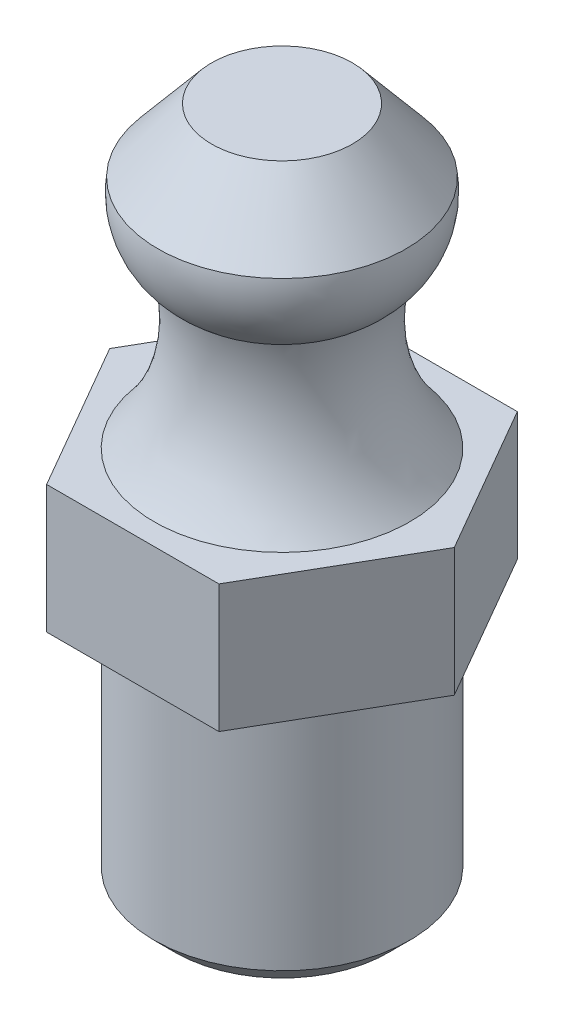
ISO-10303-21;
HEADER;
FILE_DESCRIPTION(('STEP AP214'),'2;1');
FILE_NAME('part.step','',(''),(''),'','','');
FILE_SCHEMA(('AUTOMOTIVE_DESIGN { 1 0 10303 214 1 1 1 1 }'));
ENDSEC;
DATA;
#1=APPLICATION_CONTEXT('core data for automotive mechanical design processes');
#2=APPLICATION_PROTOCOL_DEFINITION('international standard','automotive_design',2000,#1);
#3=PRODUCT_CONTEXT('',#1,'mechanical');
#4=PRODUCT('Part','Part','',(#3));
#5=PRODUCT_RELATED_PRODUCT_CATEGORY('part','',(#4));
#6=PRODUCT_DEFINITION_FORMATION('','',#4);
#7=PRODUCT_DEFINITION_CONTEXT('part definition',#1,'design');
#8=PRODUCT_DEFINITION('design','',#6,#7);
#9=PRODUCT_DEFINITION_SHAPE('','',#8);
#10=(LENGTH_UNIT() NAMED_UNIT(*) SI_UNIT(.MILLI.,.METRE.));
#11=(NAMED_UNIT(*) PLANE_ANGLE_UNIT() SI_UNIT($,.RADIAN.));
#12=(NAMED_UNIT(*) SI_UNIT($,.STERADIAN.) SOLID_ANGLE_UNIT());
#13=UNCERTAINTY_MEASURE_WITH_UNIT(LENGTH_MEASURE(1.E-05),#10,'distance_accuracy_value','');
#14=(GEOMETRIC_REPRESENTATION_CONTEXT(3) GLOBAL_UNCERTAINTY_ASSIGNED_CONTEXT((#13)) GLOBAL_UNIT_ASSIGNED_CONTEXT((#10,
#11,#12)) REPRESENTATION_CONTEXT('',''));
#15=CARTESIAN_POINT('',(0.,0.,0.));
#16=DIRECTION('',(0.,0.,1.));
#17=DIRECTION('',(1.,0.,0.));
#18=AXIS2_PLACEMENT_3D('',#15,#16,#17);
#19=CARTESIAN_POINT('',(6.06217782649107,3.,3.5));
#20=DIRECTION('',(0.,1.,0.));
#21=DIRECTION('',(0.,0.,1.));
#22=AXIS2_PLACEMENT_3D('',#19,#20,#21);
#23=PLANE('',#22);
#24=DIRECTION('',(1.,0.,0.));
#25=VECTOR('',#24,1.);
#26=CARTESIAN_POINT('',(-2.02072594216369,3.,3.5));
#27=LINE('',#26,#25);
#28=CARTESIAN_POINT('',(-2.02072594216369,3.,3.5));
#29=VERTEX_POINT('',#28);
#30=CARTESIAN_POINT('',(2.02072594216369,3.,3.5));
#31=VERTEX_POINT('',#30);
#32=EDGE_CURVE('E131',#29,#31,#27,.T.);
#33=ORIENTED_EDGE('',*,*,#32,.T.);
#34=DIRECTION('',(0.5,0.,-0.866025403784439));
#35=VECTOR('',#34,1.);
#36=CARTESIAN_POINT('',(2.02072594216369,3.,3.5));
#37=LINE('',#36,#35);
#38=CARTESIAN_POINT('',(4.04145188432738,3.,0.));
#39=VERTEX_POINT('',#38);
#40=EDGE_CURVE('E89',#31,#39,#37,.T.);
#41=ORIENTED_EDGE('',*,*,#40,.T.);
#42=DIRECTION('',(-0.5,0.,-0.866025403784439));
#43=VECTOR('',#42,1.);
#44=CARTESIAN_POINT('',(4.04145188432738,3.,0.));
#45=LINE('',#44,#43);
#46=CARTESIAN_POINT('',(2.02072594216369,3.,-3.5));
#47=VERTEX_POINT('',#46);
#48=EDGE_CURVE('E102',#39,#47,#45,.T.);
#49=ORIENTED_EDGE('',*,*,#48,.T.);
#50=DIRECTION('',(-1.,0.,0.));
#51=VECTOR('',#50,1.);
#52=CARTESIAN_POINT('',(2.02072594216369,3.,-3.5));
#53=LINE('',#52,#51);
#54=CARTESIAN_POINT('',(-2.02072594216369,3.,-3.5));
#55=VERTEX_POINT('',#54);
#56=EDGE_CURVE('E96',#47,#55,#53,.T.);
#57=ORIENTED_EDGE('',*,*,#56,.T.);
#58=DIRECTION('',(-0.5,0.,0.866025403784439));
#59=VECTOR('',#58,1.);
#60=CARTESIAN_POINT('',(-2.02072594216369,3.,-3.5));
#61=LINE('',#60,#59);
#62=CARTESIAN_POINT('',(-4.04145188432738,3.,0.));
#63=VERTEX_POINT('',#62);
#64=EDGE_CURVE('E100',#55,#63,#61,.T.);
#65=ORIENTED_EDGE('',*,*,#64,.T.);
#66=DIRECTION('',(0.5,0.,0.866025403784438));
#67=VECTOR('',#66,1.);
#68=CARTESIAN_POINT('',(-4.04145188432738,3.,0.));
#69=LINE('',#68,#67);
#70=EDGE_CURVE('E51',#63,#29,#69,.T.);
#71=ORIENTED_EDGE('',*,*,#70,.T.);
#72=EDGE_LOOP('',(#33,#41,#49,#57,#65,#71));
#73=FACE_BOUND('',#72,.T.);
#74=CARTESIAN_POINT('',(0.,3.,0.));
#75=DIRECTION('',(0.,-1.,0.));
#76=DIRECTION('',(0.,0.,-1.));
#77=AXIS2_PLACEMENT_3D('',#74,#75,#76);
#78=CIRCLE('',#77,3.);
#79=CARTESIAN_POINT('',(0.,3.,-3.));
#80=VERTEX_POINT('',#79);
#81=EDGE_CURVE('E296',#80,#80,#78,.T.);
#82=ORIENTED_EDGE('',*,*,#81,.T.);
#83=EDGE_LOOP('',(#82));
#84=FACE_BOUND('',#83,.T.);
#85=ADVANCED_FACE('F34',(#73,#84),#23,.T.);
#86=CARTESIAN_POINT('',(0.,-6.,0.));
#87=DIRECTION('',(0.,1.,0.));
#88=DIRECTION('',(0.,0.,1.));
#89=AXIS2_PLACEMENT_3D('',#86,#87,#88);
#90=CYLINDRICAL_SURFACE('',#89,3.);
#91=CARTESIAN_POINT('',(0.,-5.5,0.));
#92=DIRECTION('',(0.,1.,0.));
#93=DIRECTION('',(0.,0.,1.));
#94=AXIS2_PLACEMENT_3D('',#91,#92,#93);
#95=CIRCLE('',#94,3.);
#96=CARTESIAN_POINT('',(0.,-5.5,3.));
#97=VERTEX_POINT('',#96);
#98=EDGE_CURVE('E43',#97,#97,#95,.T.);
#99=ORIENTED_EDGE('',*,*,#98,.T.);
#100=EDGE_LOOP('',(#99));
#101=FACE_BOUND('',#100,.T.);
#102=CARTESIAN_POINT('',(0.,0.,0.));
#103=DIRECTION('',(0.,1.,0.));
#104=DIRECTION('',(0.,0.,1.));
#105=AXIS2_PLACEMENT_3D('',#102,#103,#104);
#106=CIRCLE('',#105,3.);
#107=CARTESIAN_POINT('',(0.,0.,3.));
#108=VERTEX_POINT('',#107);
#109=EDGE_CURVE('E140',#108,#108,#106,.T.);
#110=ORIENTED_EDGE('',*,*,#109,.F.);
#111=EDGE_LOOP('',(#110));
#112=FACE_BOUND('',#111,.T.);
#113=ADVANCED_FACE('F145',(#101,#112),#90,.T.);
#114=CARTESIAN_POINT('',(0.,-6.,0.));
#115=DIRECTION('',(0.,1.,0.));
#116=DIRECTION('',(0.,0.,1.));
#117=AXIS2_PLACEMENT_3D('',#114,#115,#116);
#118=PLANE('',#117);
#119=CARTESIAN_POINT('',(0.,-6.,0.));
#120=DIRECTION('',(0.,1.,0.));
#121=DIRECTION('',(0.,0.,1.));
#122=AXIS2_PLACEMENT_3D('',#119,#120,#121);
#123=CIRCLE('',#122,2.5);
#124=CARTESIAN_POINT('',(0.,-6.,2.5));
#125=VERTEX_POINT('',#124);
#126=EDGE_CURVE('E11',#125,#125,#123,.F.);
#127=ORIENTED_EDGE('',*,*,#126,.T.);
#128=EDGE_LOOP('',(#127));
#129=FACE_BOUND('',#128,.T.);
#130=ADVANCED_FACE('F163',(#129),#118,.F.);
#131=CARTESIAN_POINT('',(-2.02072594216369,3.,3.5));
#132=DIRECTION('',(0.,0.,-1.));
#133=DIRECTION('',(-1.,0.,0.));
#134=AXIS2_PLACEMENT_3D('',#131,#132,#133);
#135=PLANE('',#134);
#136=DIRECTION('',(1.,0.,0.));
#137=VECTOR('',#136,1.);
#138=CARTESIAN_POINT('',(-2.02072594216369,0.,3.5));
#139=LINE('',#138,#137);
#140=CARTESIAN_POINT('',(-2.02072594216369,0.,3.5));
#141=VERTEX_POINT('',#140);
#142=CARTESIAN_POINT('',(2.02072594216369,0.,3.5));
#143=VERTEX_POINT('',#142);
#144=EDGE_CURVE('E120',#141,#143,#139,.T.);
#145=ORIENTED_EDGE('',*,*,#144,.T.);
#146=DIRECTION('',(0.,-1.,0.));
#147=VECTOR('',#146,1.);
#148=CARTESIAN_POINT('',(2.02072594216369,3.,3.5));
#149=LINE('',#148,#147);
#150=EDGE_CURVE('E138',#31,#143,#149,.T.);
#151=ORIENTED_EDGE('',*,*,#150,.F.);
#152=ORIENTED_EDGE('',*,*,#32,.F.);
#153=DIRECTION('',(0.,-1.,0.));
#154=VECTOR('',#153,1.);
#155=CARTESIAN_POINT('',(-2.02072594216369,3.,3.5));
#156=LINE('',#155,#154);
#157=EDGE_CURVE('E116',#29,#141,#156,.T.);
#158=ORIENTED_EDGE('',*,*,#157,.T.);
#159=EDGE_LOOP('',(#145,#151,#152,#158));
#160=FACE_BOUND('',#159,.T.);
#161=ADVANCED_FACE('F186',(#160),#135,.F.);
#162=CARTESIAN_POINT('',(2.02072594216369,3.,3.5));
#163=DIRECTION('',(-0.866025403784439,0.,-0.5));
#164=DIRECTION('',(-0.5,0.,0.866025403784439));
#165=AXIS2_PLACEMENT_3D('',#162,#163,#164);
#166=PLANE('',#165);
#167=DIRECTION('',(0.5,0.,-0.866025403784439));
#168=VECTOR('',#167,1.);
#169=CARTESIAN_POINT('',(2.02072594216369,0.,3.5));
#170=LINE('',#169,#168);
#171=CARTESIAN_POINT('',(4.04145188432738,0.,0.));
#172=VERTEX_POINT('',#171);
#173=EDGE_CURVE('E123',#143,#172,#170,.T.);
#174=ORIENTED_EDGE('',*,*,#173,.T.);
#175=DIRECTION('',(0.,-1.,0.));
#176=VECTOR('',#175,1.);
#177=CARTESIAN_POINT('',(4.04145188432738,3.,0.));
#178=LINE('',#177,#176);
#179=EDGE_CURVE('E135',#39,#172,#178,.T.);
#180=ORIENTED_EDGE('',*,*,#179,.F.);
#181=ORIENTED_EDGE('',*,*,#40,.F.);
#182=ORIENTED_EDGE('',*,*,#150,.T.);
#183=EDGE_LOOP('',(#174,#180,#181,#182));
#184=FACE_BOUND('',#183,.T.);
#185=ADVANCED_FACE('F182',(#184),#166,.F.);
#186=CARTESIAN_POINT('',(4.04145188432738,3.,0.));
#187=DIRECTION('',(-0.866025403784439,0.,0.5));
#188=DIRECTION('',(0.5,0.,0.866025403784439));
#189=AXIS2_PLACEMENT_3D('',#186,#187,#188);
#190=PLANE('',#189);
#191=DIRECTION('',(-0.5,0.,-0.866025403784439));
#192=VECTOR('',#191,1.);
#193=CARTESIAN_POINT('',(4.04145188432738,0.,0.));
#194=LINE('',#193,#192);
#195=CARTESIAN_POINT('',(2.02072594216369,0.,-3.5));
#196=VERTEX_POINT('',#195);
#197=EDGE_CURVE('E126',#172,#196,#194,.T.);
#198=ORIENTED_EDGE('',*,*,#197,.T.);
#199=DIRECTION('',(0.,-1.,0.));
#200=VECTOR('',#199,1.);
#201=CARTESIAN_POINT('',(2.02072594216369,3.,-3.5));
#202=LINE('',#201,#200);
#203=EDGE_CURVE('E111',#47,#196,#202,.T.);
#204=ORIENTED_EDGE('',*,*,#203,.F.);
#205=ORIENTED_EDGE('',*,*,#48,.F.);
#206=ORIENTED_EDGE('',*,*,#179,.T.);
#207=EDGE_LOOP('',(#198,#204,#205,#206));
#208=FACE_BOUND('',#207,.T.);
#209=ADVANCED_FACE('F179',(#208),#190,.F.);
#210=CARTESIAN_POINT('',(2.02072594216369,3.,-3.5));
#211=DIRECTION('',(0.,0.,1.));
#212=DIRECTION('',(1.,0.,0.));
#213=AXIS2_PLACEMENT_3D('',#210,#211,#212);
#214=PLANE('',#213);
#215=DIRECTION('',(-1.,0.,0.));
#216=VECTOR('',#215,1.);
#217=CARTESIAN_POINT('',(2.02072594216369,0.,-3.5));
#218=LINE('',#217,#216);
#219=CARTESIAN_POINT('',(-2.02072594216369,0.,-3.5));
#220=VERTEX_POINT('',#219);
#221=EDGE_CURVE('E110',#196,#220,#218,.T.);
#222=ORIENTED_EDGE('',*,*,#221,.T.);
#223=DIRECTION('',(0.,-1.,0.));
#224=VECTOR('',#223,1.);
#225=CARTESIAN_POINT('',(-2.02072594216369,3.,-3.5));
#226=LINE('',#225,#224);
#227=EDGE_CURVE('E107',#55,#220,#226,.T.);
#228=ORIENTED_EDGE('',*,*,#227,.F.);
#229=ORIENTED_EDGE('',*,*,#56,.F.);
#230=ORIENTED_EDGE('',*,*,#203,.T.);
#231=EDGE_LOOP('',(#222,#228,#229,#230));
#232=FACE_BOUND('',#231,.T.);
#233=ADVANCED_FACE('F108',(#232),#214,.F.);
#234=CARTESIAN_POINT('',(-2.02072594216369,3.,-3.5));
#235=DIRECTION('',(0.866025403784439,0.,0.5));
#236=DIRECTION('',(0.5,0.,-0.866025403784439));
#237=AXIS2_PLACEMENT_3D('',#234,#235,#236);
#238=PLANE('',#237);
#239=DIRECTION('',(-0.5,0.,0.866025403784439));
#240=VECTOR('',#239,1.);
#241=CARTESIAN_POINT('',(-2.02072594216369,0.,-3.5));
#242=LINE('',#241,#240);
#243=CARTESIAN_POINT('',(-4.04145188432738,0.,0.));
#244=VERTEX_POINT('',#243);
#245=EDGE_CURVE('E74',#220,#244,#242,.T.);
#246=ORIENTED_EDGE('',*,*,#245,.T.);
#247=DIRECTION('',(0.,-1.,0.));
#248=VECTOR('',#247,1.);
#249=CARTESIAN_POINT('',(-4.04145188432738,3.,0.));
#250=LINE('',#249,#248);
#251=EDGE_CURVE('E112',#63,#244,#250,.T.);
#252=ORIENTED_EDGE('',*,*,#251,.F.);
#253=ORIENTED_EDGE('',*,*,#64,.F.);
#254=ORIENTED_EDGE('',*,*,#227,.T.);
#255=EDGE_LOOP('',(#246,#252,#253,#254));
#256=FACE_BOUND('',#255,.T.);
#257=ADVANCED_FACE('F114',(#256),#238,.F.);
#258=CARTESIAN_POINT('',(-4.04145188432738,3.,0.));
#259=DIRECTION('',(0.866025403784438,0.,-0.5));
#260=DIRECTION('',(-0.5,0.,-0.866025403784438));
#261=AXIS2_PLACEMENT_3D('',#258,#259,#260);
#262=PLANE('',#261);
#263=DIRECTION('',(0.5,0.,0.866025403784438));
#264=VECTOR('',#263,1.);
#265=CARTESIAN_POINT('',(-4.04145188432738,0.,0.));
#266=LINE('',#265,#264);
#267=EDGE_CURVE('E80',#244,#141,#266,.T.);
#268=ORIENTED_EDGE('',*,*,#267,.T.);
#269=ORIENTED_EDGE('',*,*,#157,.F.);
#270=ORIENTED_EDGE('',*,*,#70,.F.);
#271=ORIENTED_EDGE('',*,*,#251,.T.);
#272=EDGE_LOOP('',(#268,#269,#270,#271));
#273=FACE_BOUND('',#272,.T.);
#274=ADVANCED_FACE('F171',(#273),#262,.F.);
#275=CARTESIAN_POINT('',(6.06217782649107,0.,3.5));
#276=DIRECTION('',(0.,1.,0.));
#277=DIRECTION('',(0.,0.,1.));
#278=AXIS2_PLACEMENT_3D('',#275,#276,#277);
#279=PLANE('',#278);
#280=ORIENTED_EDGE('',*,*,#109,.T.);
#281=EDGE_LOOP('',(#280));
#282=FACE_BOUND('',#281,.T.);
#283=ORIENTED_EDGE('',*,*,#144,.F.);
#284=ORIENTED_EDGE('',*,*,#267,.F.);
#285=ORIENTED_EDGE('',*,*,#245,.F.);
#286=ORIENTED_EDGE('',*,*,#221,.F.);
#287=ORIENTED_EDGE('',*,*,#197,.F.);
#288=ORIENTED_EDGE('',*,*,#173,.F.);
#289=EDGE_LOOP('',(#283,#284,#285,#286,#287,#288));
#290=FACE_BOUND('',#289,.T.);
#291=ADVANCED_FACE('F168',(#282,#290),#279,.F.);
#292=CARTESIAN_POINT('',(0.,10.,0.));
#293=DIRECTION('',(0.,-1.,0.));
#294=DIRECTION('',(0.,0.,-1.));
#295=AXIS2_PLACEMENT_3D('',#292,#293,#294);
#296=PLANE('',#295);
#297=CARTESIAN_POINT('',(0.,10.,0.));
#298=DIRECTION('',(0.,-1.,0.));
#299=DIRECTION('',(0.,0.,-1.));
#300=AXIS2_PLACEMENT_3D('',#297,#298,#299);
#301=CIRCLE('',#300,1.65193034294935);
#302=CARTESIAN_POINT('',(0.,10.,-1.65193034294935));
#303=VERTEX_POINT('',#302);
#304=EDGE_CURVE('E124',#303,#303,#301,.T.);
#305=ORIENTED_EDGE('',*,*,#304,.F.);
#306=EDGE_LOOP('',(#305));
#307=FACE_BOUND('',#306,.T.);
#308=ADVANCED_FACE('F166',(#307),#296,.F.);
#309=CARTESIAN_POINT('',(0.,10.,0.));
#310=DIRECTION('',(0.,-1.,0.));
#311=DIRECTION('',(0.,0.,-1.));
#312=AXIS2_PLACEMENT_3D('',#309,#310,#311);
#313=CONICAL_SURFACE('',#312,1.65193034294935,0.698131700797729);
#314=CARTESIAN_POINT('',(0.,8.5,0.));
#315=DIRECTION('',(0.,-1.,0.));
#316=DIRECTION('',(0.,0.,-1.));
#317=AXIS2_PLACEMENT_3D('',#314,#315,#316);
#318=CIRCLE('',#317,2.91057978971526);
#319=CARTESIAN_POINT('',(0.,8.5,-2.91057978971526));
#320=VERTEX_POINT('',#319);
#321=EDGE_CURVE('E292',#320,#320,#318,.T.);
#322=ORIENTED_EDGE('',*,*,#321,.F.);
#323=EDGE_LOOP('',(#322));
#324=FACE_BOUND('',#323,.T.);
#325=ORIENTED_EDGE('',*,*,#304,.T.);
#326=EDGE_LOOP('',(#325));
#327=FACE_BOUND('',#326,.T.);
#328=ADVANCED_FACE('F230',(#324,#327),#313,.T.);
#329=CARTESIAN_POINT('',(0.,8.20703185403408,0.));
#330=DIRECTION('',(0.,-1.,0.));
#331=DIRECTION('',(0.,0.,-1.));
#332=AXIS2_PLACEMENT_3D('',#329,#330,#331);
#333=DEGENERATE_TOROIDAL_SURFACE('',#332,0.932153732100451,2.,.T.);
#334=CARTESIAN_POINT('',(0.,6.62716563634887,0.));
#335=DIRECTION('',(0.,-1.,0.));
#336=DIRECTION('',(0.,0.,-1.));
#337=AXIS2_PLACEMENT_3D('',#334,#335,#336);
#338=CIRCLE('',#337,2.15853977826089);
#339=CARTESIAN_POINT('',(0.,6.62716563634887,-2.15853977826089));
#340=VERTEX_POINT('',#339);
#341=EDGE_CURVE('E289',#340,#340,#338,.T.);
#342=ORIENTED_EDGE('',*,*,#341,.F.);
#343=EDGE_LOOP('',(#342));
#344=FACE_BOUND('',#343,.T.);
#345=ORIENTED_EDGE('',*,*,#321,.T.);
#346=EDGE_LOOP('',(#345));
#347=FACE_BOUND('',#346,.T.);
#348=ADVANCED_FACE('F154',(#344,#347),#333,.T.);
#349=CARTESIAN_POINT('',(0.,5.61364998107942,0.));
#350=DIRECTION('',(0.,-1.,0.));
#351=DIRECTION('',(0.,0.,-1.));
#352=AXIS2_PLACEMENT_3D('',#349,#350,#351);
#353=TOROIDAL_SURFACE('',#352,6.02800821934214,4.);
#354=ORIENTED_EDGE('',*,*,#81,.F.);
#355=EDGE_LOOP('',(#354));
#356=FACE_BOUND('',#355,.T.);
#357=ORIENTED_EDGE('',*,*,#341,.T.);
#358=EDGE_LOOP('',(#357));
#359=FACE_BOUND('',#358,.T.);
#360=ADVANCED_FACE('F149',(#356,#359),#353,.F.);
#361=CARTESIAN_POINT('',(0.,-5.5,0.));
#362=DIRECTION('',(0.,1.,0.));
#363=DIRECTION('',(0.,0.,1.));
#364=AXIS2_PLACEMENT_3D('',#361,#362,#363);
#365=CONICAL_SURFACE('',#364,3.,0.78539816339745);
#366=ORIENTED_EDGE('',*,*,#126,.F.);
#367=EDGE_LOOP('',(#366));
#368=FACE_BOUND('',#367,.T.);
#369=ORIENTED_EDGE('',*,*,#98,.F.);
#370=EDGE_LOOP('',(#369));
#371=FACE_BOUND('',#370,.T.);
#372=ADVANCED_FACE('F36',(#368,#371),#365,.T.);
#373=CLOSED_SHELL('',(#85,#113,#130,#161,#185,#209,#233,#257,#274,#291,#308,#328,#348,#360,#372));
#374=MANIFOLD_SOLID_BREP('B2',#373);
#375=ADVANCED_BREP_SHAPE_REPRESENTATION('',(#18,#374),#14);
#376=SHAPE_DEFINITION_REPRESENTATION(#9,#375);
ENDSEC;
END-ISO-10303-21;
